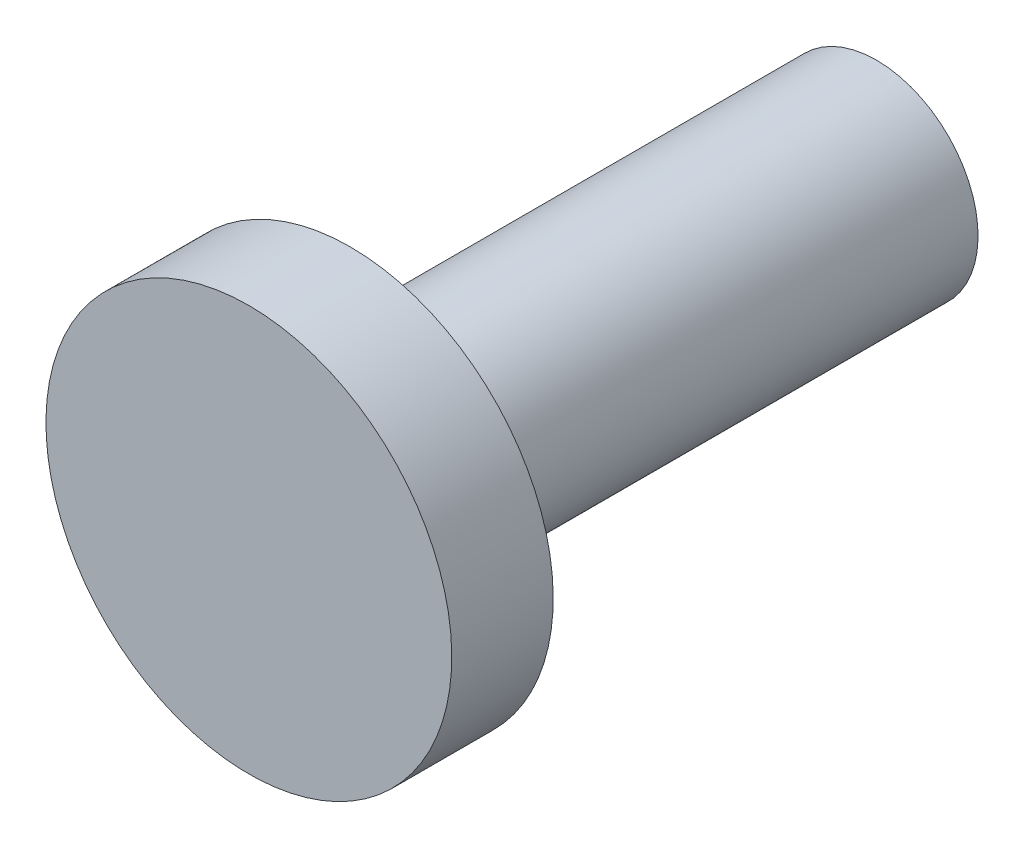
ISO-10303-21;
HEADER;
FILE_DESCRIPTION(('STEP AP214'),'2;1');
FILE_NAME('part.step','',(''),(''),'','','');
FILE_SCHEMA(('AUTOMOTIVE_DESIGN { 1 0 10303 214 1 1 1 1 }'));
ENDSEC;
DATA;
#1=APPLICATION_CONTEXT('core data for automotive mechanical design processes');
#2=APPLICATION_PROTOCOL_DEFINITION('international standard','automotive_design',2000,#1);
#3=PRODUCT_CONTEXT('',#1,'mechanical');
#4=PRODUCT('Part','Part','',(#3));
#5=PRODUCT_RELATED_PRODUCT_CATEGORY('part','',(#4));
#6=PRODUCT_DEFINITION_FORMATION('','',#4);
#7=PRODUCT_DEFINITION_CONTEXT('part definition',#1,'design');
#8=PRODUCT_DEFINITION('design','',#6,#7);
#9=PRODUCT_DEFINITION_SHAPE('','',#8);
#10=(LENGTH_UNIT() NAMED_UNIT(*) SI_UNIT(.MILLI.,.METRE.));
#11=(NAMED_UNIT(*) PLANE_ANGLE_UNIT() SI_UNIT($,.RADIAN.));
#12=(NAMED_UNIT(*) SI_UNIT($,.STERADIAN.) SOLID_ANGLE_UNIT());
#13=UNCERTAINTY_MEASURE_WITH_UNIT(LENGTH_MEASURE(1.E-05),#10,'distance_accuracy_value','');
#14=(GEOMETRIC_REPRESENTATION_CONTEXT(3) GLOBAL_UNCERTAINTY_ASSIGNED_CONTEXT((#13)) GLOBAL_UNIT_ASSIGNED_CONTEXT((#10,
#11,#12)) REPRESENTATION_CONTEXT('',''));
#15=CARTESIAN_POINT('',(0.,0.,0.));
#16=DIRECTION('',(0.,0.,1.));
#17=DIRECTION('',(1.,0.,0.));
#18=AXIS2_PLACEMENT_3D('',#15,#16,#17);
#19=CARTESIAN_POINT('',(0.,0.,-41.5));
#20=DIRECTION('',(0.,0.,-1.));
#21=DIRECTION('',(0.,1.,0.));
#22=AXIS2_PLACEMENT_3D('',#19,#20,#21);
#23=PLANE('',#22);
#24=CARTESIAN_POINT('',(0.,0.,-41.5));
#25=DIRECTION('',(0.,0.,-1.));
#26=DIRECTION('',(0.,1.,0.));
#27=AXIS2_PLACEMENT_3D('',#24,#25,#26);
#28=CIRCLE('',#27,8.);
#29=CARTESIAN_POINT('',(0.,8.,-41.5));
#30=VERTEX_POINT('',#29);
#31=EDGE_CURVE('E8',#30,#30,#28,.T.);
#32=ORIENTED_EDGE('',*,*,#31,.T.);
#33=EDGE_LOOP('',(#32));
#34=FACE_BOUND('',#33,.T.);
#35=ADVANCED_FACE('F12',(#34),#23,.T.);
#36=CARTESIAN_POINT('',(0.,0.,-51.5));
#37=DIRECTION('',(0.,0.,-1.));
#38=DIRECTION('',(0.,1.,0.));
#39=AXIS2_PLACEMENT_3D('',#36,#37,#38);
#40=CYLINDRICAL_SURFACE('',#39,8.);
#41=CARTESIAN_POINT('',(0.,0.,0.));
#42=DIRECTION('',(0.,0.,-1.));
#43=DIRECTION('',(0.,1.,0.));
#44=AXIS2_PLACEMENT_3D('',#41,#42,#43);
#45=CIRCLE('',#44,8.);
#46=CARTESIAN_POINT('',(0.,8.,0.));
#47=VERTEX_POINT('',#46);
#48=EDGE_CURVE('E18',#47,#47,#45,.T.);
#49=ORIENTED_EDGE('',*,*,#48,.T.);
#50=EDGE_LOOP('',(#49));
#51=FACE_BOUND('',#50,.T.);
#52=ORIENTED_EDGE('',*,*,#31,.F.);
#53=EDGE_LOOP('',(#52));
#54=FACE_BOUND('',#53,.T.);
#55=ADVANCED_FACE('F45',(#51,#54),#40,.T.);
#56=CARTESIAN_POINT('',(8.,0.,0.));
#57=DIRECTION('',(0.,0.,-1.));
#58=DIRECTION('',(0.,1.,0.));
#59=AXIS2_PLACEMENT_3D('',#56,#57,#58);
#60=PLANE('',#59);
#61=CARTESIAN_POINT('',(0.,0.,0.));
#62=DIRECTION('',(0.,0.,-1.));
#63=DIRECTION('',(0.,1.,0.));
#64=AXIS2_PLACEMENT_3D('',#61,#62,#63);
#65=CIRCLE('',#64,16.);
#66=CARTESIAN_POINT('',(0.,16.,0.));
#67=VERTEX_POINT('',#66);
#68=EDGE_CURVE('E22',#67,#67,#65,.T.);
#69=ORIENTED_EDGE('',*,*,#68,.T.);
#70=EDGE_LOOP('',(#69));
#71=FACE_BOUND('',#70,.T.);
#72=ORIENTED_EDGE('',*,*,#48,.F.);
#73=EDGE_LOOP('',(#72));
#74=FACE_BOUND('',#73,.T.);
#75=ADVANCED_FACE('F42',(#71,#74),#60,.T.);
#76=CARTESIAN_POINT('',(0.,0.,-51.5));
#77=DIRECTION('',(0.,0.,-1.));
#78=DIRECTION('',(0.,1.,0.));
#79=AXIS2_PLACEMENT_3D('',#76,#77,#78);
#80=CYLINDRICAL_SURFACE('',#79,16.);
#81=CARTESIAN_POINT('',(0.,0.,8.));
#82=DIRECTION('',(0.,0.,-1.));
#83=DIRECTION('',(0.,1.,0.));
#84=AXIS2_PLACEMENT_3D('',#81,#82,#83);
#85=CIRCLE('',#84,16.);
#86=CARTESIAN_POINT('',(0.,16.,8.));
#87=VERTEX_POINT('',#86);
#88=EDGE_CURVE('E26',#87,#87,#85,.T.);
#89=ORIENTED_EDGE('',*,*,#88,.T.);
#90=EDGE_LOOP('',(#89));
#91=FACE_BOUND('',#90,.T.);
#92=ORIENTED_EDGE('',*,*,#68,.F.);
#93=EDGE_LOOP('',(#92));
#94=FACE_BOUND('',#93,.T.);
#95=ADVANCED_FACE('F32',(#91,#94),#80,.T.);
#96=CARTESIAN_POINT('',(16.,0.,8.));
#97=DIRECTION('',(0.,0.,1.));
#98=DIRECTION('',(0.,-1.,0.));
#99=AXIS2_PLACEMENT_3D('',#96,#97,#98);
#100=PLANE('',#99);
#101=ORIENTED_EDGE('',*,*,#88,.F.);
#102=EDGE_LOOP('',(#101));
#103=FACE_BOUND('',#102,.T.);
#104=ADVANCED_FACE('F35',(#103),#100,.T.);
#105=CLOSED_SHELL('',(#35,#55,#75,#95,#104));
#106=MANIFOLD_SOLID_BREP('B1',#105);
#107=ADVANCED_BREP_SHAPE_REPRESENTATION('',(#18,#106),#14);
#108=SHAPE_DEFINITION_REPRESENTATION(#9,#107);
ENDSEC;
END-ISO-10303-21;
